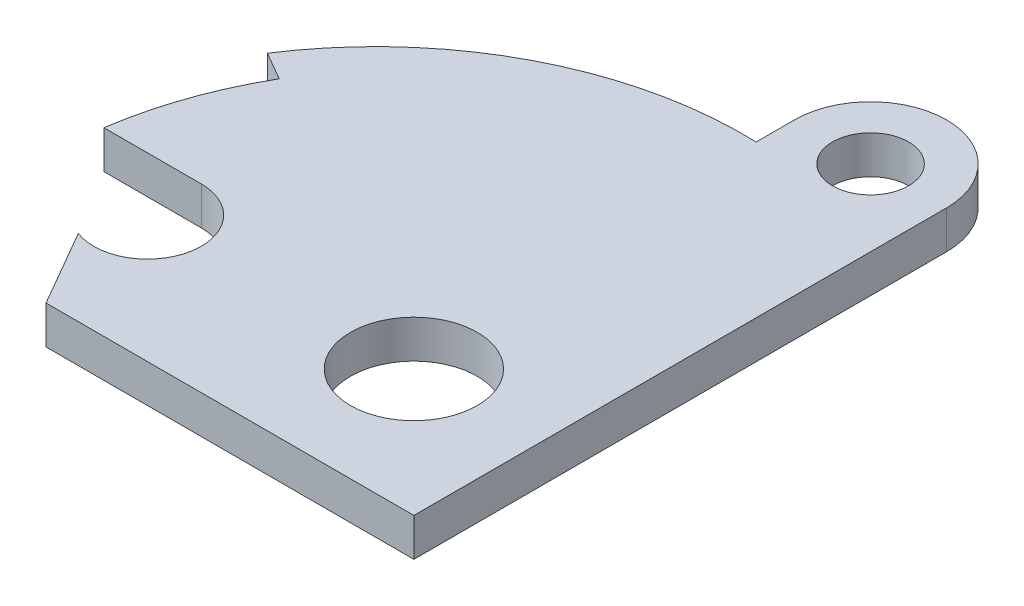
ISO-10303-21;
HEADER;
FILE_DESCRIPTION(('STEP AP214'),'2;1');
FILE_NAME('part.step','',(''),(''),'','','');
FILE_SCHEMA(('AUTOMOTIVE_DESIGN { 1 0 10303 214 1 1 1 1 }'));
ENDSEC;
DATA;
#1=APPLICATION_CONTEXT('core data for automotive mechanical design processes');
#2=APPLICATION_PROTOCOL_DEFINITION('international standard','automotive_design',2000,#1);
#3=PRODUCT_CONTEXT('',#1,'mechanical');
#4=PRODUCT('Part','Part','',(#3));
#5=PRODUCT_RELATED_PRODUCT_CATEGORY('part','',(#4));
#6=PRODUCT_DEFINITION_FORMATION('','',#4);
#7=PRODUCT_DEFINITION_CONTEXT('part definition',#1,'design');
#8=PRODUCT_DEFINITION('design','',#6,#7);
#9=PRODUCT_DEFINITION_SHAPE('','',#8);
#10=(LENGTH_UNIT() NAMED_UNIT(*) SI_UNIT(.MILLI.,.METRE.));
#11=(NAMED_UNIT(*) PLANE_ANGLE_UNIT() SI_UNIT($,.RADIAN.));
#12=(NAMED_UNIT(*) SI_UNIT($,.STERADIAN.) SOLID_ANGLE_UNIT());
#13=UNCERTAINTY_MEASURE_WITH_UNIT(LENGTH_MEASURE(1.E-05),#10,'distance_accuracy_value','');
#14=(GEOMETRIC_REPRESENTATION_CONTEXT(3) GLOBAL_UNCERTAINTY_ASSIGNED_CONTEXT((#13)) GLOBAL_UNIT_ASSIGNED_CONTEXT((#10,
#11,#12)) REPRESENTATION_CONTEXT('',''));
#15=CARTESIAN_POINT('',(0.,0.,0.));
#16=DIRECTION('',(0.,0.,1.));
#17=DIRECTION('',(1.,0.,0.));
#18=AXIS2_PLACEMENT_3D('',#15,#16,#17);
#19=CARTESIAN_POINT('',(-31.,3.,-10.));
#20=DIRECTION('',(0.,1.,0.));
#21=DIRECTION('',(0.,0.,1.));
#22=AXIS2_PLACEMENT_3D('',#19,#20,#21);
#23=PLANE('',#22);
#24=CARTESIAN_POINT('',(-6.,3.,-42.));
#25=DIRECTION('',(0.,1.,0.));
#26=DIRECTION('',(0.,0.,1.));
#27=AXIS2_PLACEMENT_3D('',#24,#25,#26);
#28=CIRCLE('',#27,3.);
#29=CARTESIAN_POINT('',(-6.,3.,-39.));
#30=VERTEX_POINT('',#29);
#31=EDGE_CURVE('E143',#30,#30,#28,.T.);
#32=ORIENTED_EDGE('',*,*,#31,.F.);
#33=EDGE_LOOP('',(#32));
#34=FACE_BOUND('',#33,.T.);
#35=DIRECTION('',(1.,0.,0.));
#36=VECTOR('',#35,1.);
#37=CARTESIAN_POINT('',(0.,3.,0.));
#38=LINE('',#37,#36);
#39=CARTESIAN_POINT('',(-29.,3.,0.));
#40=VERTEX_POINT('',#39);
#41=CARTESIAN_POINT('',(0.,3.,0.));
#42=VERTEX_POINT('',#41);
#43=EDGE_CURVE('E158',#40,#42,#38,.T.);
#44=ORIENTED_EDGE('',*,*,#43,.T.);
#45=DIRECTION('',(0.,0.,-1.));
#46=VECTOR('',#45,1.);
#47=CARTESIAN_POINT('',(0.,3.,0.));
#48=LINE('',#47,#46);
#49=CARTESIAN_POINT('',(0.,3.,-42.));
#50=VERTEX_POINT('',#49);
#51=EDGE_CURVE('E96',#42,#50,#48,.T.);
#52=ORIENTED_EDGE('',*,*,#51,.T.);
#53=CARTESIAN_POINT('',(-6.,3.,-42.));
#54=DIRECTION('',(0.,1.,0.));
#55=DIRECTION('',(0.,0.,1.));
#56=AXIS2_PLACEMENT_3D('',#53,#54,#55);
#57=CIRCLE('',#56,6.);
#58=CARTESIAN_POINT('',(-12.,3.,-42.));
#59=VERTEX_POINT('',#58);
#60=EDGE_CURVE('E179',#50,#59,#57,.T.);
#61=ORIENTED_EDGE('',*,*,#60,.T.);
#62=DIRECTION('',(0.,0.,1.));
#63=VECTOR('',#62,1.);
#64=CARTESIAN_POINT('',(-12.,3.,-38.9827534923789));
#65=LINE('',#64,#63);
#66=CARTESIAN_POINT('',(-12.,3.,-38.9827534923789));
#67=VERTEX_POINT('',#66);
#68=EDGE_CURVE('E198',#59,#67,#65,.T.);
#69=ORIENTED_EDGE('',*,*,#68,.T.);
#70=CARTESIAN_POINT('',(-13.,3.,-10.));
#71=DIRECTION('',(0.,1.,0.));
#72=DIRECTION('',(0.,0.,1.));
#73=AXIS2_PLACEMENT_3D('',#70,#71,#72);
#74=CIRCLE('',#73,29.);
#75=CARTESIAN_POINT('',(-37.3311183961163,3.,-25.7796285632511));
#76=VERTEX_POINT('',#75);
#77=EDGE_CURVE('E195',#67,#76,#74,.T.);
#78=ORIENTED_EDGE('',*,*,#77,.T.);
#79=DIRECTION('',(0.866025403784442,0.,0.499999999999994));
#80=VECTOR('',#79,1.);
#81=CARTESIAN_POINT('',(-35.1147367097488,3.,-24.4999999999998));
#82=LINE('',#81,#80);
#83=CARTESIAN_POINT('',(-35.1147367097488,3.,-24.4999999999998));
#84=VERTEX_POINT('',#83);
#85=EDGE_CURVE('E197',#76,#84,#82,.T.);
#86=ORIENTED_EDGE('',*,*,#85,.T.);
#87=CARTESIAN_POINT('',(-10.,3.,-10.));
#88=DIRECTION('',(0.,1.,0.));
#89=DIRECTION('',(0.,0.,1.));
#90=AXIS2_PLACEMENT_3D('',#87,#88,#89);
#91=CIRCLE('',#90,29.);
#92=CARTESIAN_POINT('',(-38.6868872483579,3.,-14.25));
#93=VERTEX_POINT('',#92);
#94=EDGE_CURVE('E121',#84,#93,#91,.T.);
#95=ORIENTED_EDGE('',*,*,#94,.T.);
#96=DIRECTION('',(1.,0.,0.));
#97=VECTOR('',#96,1.);
#98=CARTESIAN_POINT('',(-31.,3.,-14.25));
#99=LINE('',#98,#97);
#100=CARTESIAN_POINT('',(-31.,3.,-14.25));
#101=VERTEX_POINT('',#100);
#102=EDGE_CURVE('E115',#93,#101,#99,.T.);
#103=ORIENTED_EDGE('',*,*,#102,.T.);
#104=CARTESIAN_POINT('',(-31.,3.,-10.));
#105=DIRECTION('',(0.,-1.,0.));
#106=DIRECTION('',(0.,0.,1.));
#107=AXIS2_PLACEMENT_3D('',#104,#105,#106);
#108=CIRCLE('',#107,4.25000000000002);
#109=CARTESIAN_POINT('',(-32.4715424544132,3.,-6.01288791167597));
#110=VERTEX_POINT('',#109);
#111=EDGE_CURVE('E119',#101,#110,#108,.T.);
#112=ORIENTED_EDGE('',*,*,#111,.T.);
#113=DIRECTION('',(0.500000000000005,0.,0.866025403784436));
#114=VECTOR('',#113,1.);
#115=CARTESIAN_POINT('',(-29.,3.,0.));
#116=LINE('',#115,#114);
#117=EDGE_CURVE('E47',#110,#40,#116,.T.);
#118=ORIENTED_EDGE('',*,*,#117,.T.);
#119=EDGE_LOOP('',(#44,#52,#61,#69,#78,#86,#95,#103,#112,#118));
#120=FACE_BOUND('',#119,.T.);
#121=CARTESIAN_POINT('',(-10.,3.,-10.));
#122=DIRECTION('',(0.,1.,0.));
#123=DIRECTION('',(0.,0.,1.));
#124=AXIS2_PLACEMENT_3D('',#121,#122,#123);
#125=CIRCLE('',#124,5.);
#126=CARTESIAN_POINT('',(-10.,3.,-5.));
#127=VERTEX_POINT('',#126);
#128=EDGE_CURVE('E209',#127,#127,#125,.T.);
#129=ORIENTED_EDGE('',*,*,#128,.F.);
#130=EDGE_LOOP('',(#129));
#131=FACE_BOUND('',#130,.T.);
#132=ADVANCED_FACE('F30',(#34,#120,#131),#23,.T.);
#133=CARTESIAN_POINT('',(-31.,0.,-10.));
#134=DIRECTION('',(0.,1.,0.));
#135=DIRECTION('',(0.,0.,1.));
#136=AXIS2_PLACEMENT_3D('',#133,#134,#135);
#137=PLANE('',#136);
#138=CARTESIAN_POINT('',(-6.,0.,-42.));
#139=DIRECTION('',(0.,1.,0.));
#140=DIRECTION('',(0.,0.,1.));
#141=AXIS2_PLACEMENT_3D('',#138,#139,#140);
#142=CIRCLE('',#141,3.);
#143=CARTESIAN_POINT('',(-6.,0.,-39.));
#144=VERTEX_POINT('',#143);
#145=EDGE_CURVE('E206',#144,#144,#142,.T.);
#146=ORIENTED_EDGE('',*,*,#145,.T.);
#147=EDGE_LOOP('',(#146));
#148=FACE_BOUND('',#147,.T.);
#149=DIRECTION('',(1.,0.,0.));
#150=VECTOR('',#149,1.);
#151=CARTESIAN_POINT('',(0.,0.,0.));
#152=LINE('',#151,#150);
#153=CARTESIAN_POINT('',(-29.,0.,0.));
#154=VERTEX_POINT('',#153);
#155=CARTESIAN_POINT('',(0.,0.,0.));
#156=VERTEX_POINT('',#155);
#157=EDGE_CURVE('E139',#154,#156,#152,.T.);
#158=ORIENTED_EDGE('',*,*,#157,.F.);
#159=DIRECTION('',(0.500000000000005,0.,0.866025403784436));
#160=VECTOR('',#159,1.);
#161=CARTESIAN_POINT('',(-29.,0.,0.));
#162=LINE('',#161,#160);
#163=CARTESIAN_POINT('',(-32.4715424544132,0.,-6.01288791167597));
#164=VERTEX_POINT('',#163);
#165=EDGE_CURVE('E88',#164,#154,#162,.T.);
#166=ORIENTED_EDGE('',*,*,#165,.F.);
#167=CARTESIAN_POINT('',(-31.,0.,-10.));
#168=DIRECTION('',(0.,-1.,0.));
#169=DIRECTION('',(0.,0.,1.));
#170=AXIS2_PLACEMENT_3D('',#167,#168,#169);
#171=CIRCLE('',#170,4.25000000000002);
#172=CARTESIAN_POINT('',(-31.,0.,-14.25));
#173=VERTEX_POINT('',#172);
#174=EDGE_CURVE('E82',#173,#164,#171,.T.);
#175=ORIENTED_EDGE('',*,*,#174,.F.);
#176=DIRECTION('',(1.,0.,0.));
#177=VECTOR('',#176,1.);
#178=CARTESIAN_POINT('',(-31.,0.,-14.25));
#179=LINE('',#178,#177);
#180=CARTESIAN_POINT('',(-38.6868872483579,0.,-14.25));
#181=VERTEX_POINT('',#180);
#182=EDGE_CURVE('E129',#181,#173,#179,.T.);
#183=ORIENTED_EDGE('',*,*,#182,.F.);
#184=CARTESIAN_POINT('',(-10.,0.,-10.));
#185=DIRECTION('',(0.,1.,0.));
#186=DIRECTION('',(0.,0.,1.));
#187=AXIS2_PLACEMENT_3D('',#184,#185,#186);
#188=CIRCLE('',#187,29.);
#189=CARTESIAN_POINT('',(-35.1147367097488,0.,-24.4999999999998));
#190=VERTEX_POINT('',#189);
#191=EDGE_CURVE('E153',#190,#181,#188,.T.);
#192=ORIENTED_EDGE('',*,*,#191,.F.);
#193=DIRECTION('',(0.866025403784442,0.,0.499999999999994));
#194=VECTOR('',#193,1.);
#195=CARTESIAN_POINT('',(-35.1147367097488,0.,-24.4999999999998));
#196=LINE('',#195,#194);
#197=CARTESIAN_POINT('',(-37.3311183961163,0.,-25.7796285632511));
#198=VERTEX_POINT('',#197);
#199=EDGE_CURVE('E151',#198,#190,#196,.T.);
#200=ORIENTED_EDGE('',*,*,#199,.F.);
#201=CARTESIAN_POINT('',(-13.,0.,-10.));
#202=DIRECTION('',(0.,1.,0.));
#203=DIRECTION('',(0.,0.,1.));
#204=AXIS2_PLACEMENT_3D('',#201,#202,#203);
#205=CIRCLE('',#204,29.);
#206=CARTESIAN_POINT('',(-12.,0.,-38.9827534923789));
#207=VERTEX_POINT('',#206);
#208=EDGE_CURVE('E149',#207,#198,#205,.T.);
#209=ORIENTED_EDGE('',*,*,#208,.F.);
#210=DIRECTION('',(0.,0.,1.));
#211=VECTOR('',#210,1.);
#212=CARTESIAN_POINT('',(-12.,0.,-38.9827534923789));
#213=LINE('',#212,#211);
#214=CARTESIAN_POINT('',(-12.,0.,-42.));
#215=VERTEX_POINT('',#214);
#216=EDGE_CURVE('E147',#215,#207,#213,.T.);
#217=ORIENTED_EDGE('',*,*,#216,.F.);
#218=CARTESIAN_POINT('',(-6.,0.,-42.));
#219=DIRECTION('',(0.,1.,0.));
#220=DIRECTION('',(0.,0.,1.));
#221=AXIS2_PLACEMENT_3D('',#218,#219,#220);
#222=CIRCLE('',#221,6.);
#223=CARTESIAN_POINT('',(0.,0.,-42.));
#224=VERTEX_POINT('',#223);
#225=EDGE_CURVE('E145',#224,#215,#222,.T.);
#226=ORIENTED_EDGE('',*,*,#225,.F.);
#227=DIRECTION('',(0.,0.,-1.));
#228=VECTOR('',#227,1.);
#229=CARTESIAN_POINT('',(0.,0.,0.));
#230=LINE('',#229,#228);
#231=EDGE_CURVE('E142',#156,#224,#230,.T.);
#232=ORIENTED_EDGE('',*,*,#231,.F.);
#233=EDGE_LOOP('',(#158,#166,#175,#183,#192,#200,#209,#217,#226,#232));
#234=FACE_BOUND('',#233,.T.);
#235=CARTESIAN_POINT('',(-10.,0.,-10.));
#236=DIRECTION('',(0.,1.,0.));
#237=DIRECTION('',(0.,0.,1.));
#238=AXIS2_PLACEMENT_3D('',#235,#236,#237);
#239=CIRCLE('',#238,5.);
#240=CARTESIAN_POINT('',(-10.,0.,-5.));
#241=VERTEX_POINT('',#240);
#242=EDGE_CURVE('E212',#241,#241,#239,.T.);
#243=ORIENTED_EDGE('',*,*,#242,.T.);
#244=EDGE_LOOP('',(#243));
#245=FACE_BOUND('',#244,.T.);
#246=ADVANCED_FACE('F183',(#148,#234,#245),#137,.F.);
#247=CARTESIAN_POINT('',(0.,3.,0.));
#248=DIRECTION('',(0.,0.,-1.));
#249=DIRECTION('',(-1.,0.,0.));
#250=AXIS2_PLACEMENT_3D('',#247,#248,#249);
#251=PLANE('',#250);
#252=ORIENTED_EDGE('',*,*,#157,.T.);
#253=DIRECTION('',(0.,-1.,0.));
#254=VECTOR('',#253,1.);
#255=CARTESIAN_POINT('',(0.,3.,0.));
#256=LINE('',#255,#254);
#257=EDGE_CURVE('E11',#42,#156,#256,.T.);
#258=ORIENTED_EDGE('',*,*,#257,.F.);
#259=ORIENTED_EDGE('',*,*,#43,.F.);
#260=DIRECTION('',(0.,-1.,0.));
#261=VECTOR('',#260,1.);
#262=CARTESIAN_POINT('',(-29.,3.,0.));
#263=LINE('',#262,#261);
#264=EDGE_CURVE('E135',#40,#154,#263,.T.);
#265=ORIENTED_EDGE('',*,*,#264,.T.);
#266=EDGE_LOOP('',(#252,#258,#259,#265));
#267=FACE_BOUND('',#266,.T.);
#268=ADVANCED_FACE('F32',(#267),#251,.F.);
#269=CARTESIAN_POINT('',(0.,3.,0.));
#270=DIRECTION('',(-1.,0.,0.));
#271=DIRECTION('',(0.,0.,1.));
#272=AXIS2_PLACEMENT_3D('',#269,#270,#271);
#273=PLANE('',#272);
#274=ORIENTED_EDGE('',*,*,#231,.T.);
#275=DIRECTION('',(0.,-1.,0.));
#276=VECTOR('',#275,1.);
#277=CARTESIAN_POINT('',(0.,3.,-42.));
#278=LINE('',#277,#276);
#279=EDGE_CURVE('E39',#50,#224,#278,.T.);
#280=ORIENTED_EDGE('',*,*,#279,.F.);
#281=ORIENTED_EDGE('',*,*,#51,.F.);
#282=ORIENTED_EDGE('',*,*,#257,.T.);
#283=EDGE_LOOP('',(#274,#280,#281,#282));
#284=FACE_BOUND('',#283,.T.);
#285=ADVANCED_FACE('F253',(#284),#273,.F.);
#286=CARTESIAN_POINT('',(-6.,3.,-42.));
#287=DIRECTION('',(0.,-1.,0.));
#288=DIRECTION('',(0.,0.,-1.));
#289=AXIS2_PLACEMENT_3D('',#286,#287,#288);
#290=CYLINDRICAL_SURFACE('',#289,6.);
#291=ORIENTED_EDGE('',*,*,#225,.T.);
#292=DIRECTION('',(0.,-1.,0.));
#293=VECTOR('',#292,1.);
#294=CARTESIAN_POINT('',(-12.,3.,-42.));
#295=LINE('',#294,#293);
#296=EDGE_CURVE('E171',#59,#215,#295,.T.);
#297=ORIENTED_EDGE('',*,*,#296,.F.);
#298=ORIENTED_EDGE('',*,*,#60,.F.);
#299=ORIENTED_EDGE('',*,*,#279,.T.);
#300=EDGE_LOOP('',(#291,#297,#298,#299));
#301=FACE_BOUND('',#300,.T.);
#302=ADVANCED_FACE('F177',(#301),#290,.T.);
#303=CARTESIAN_POINT('',(-12.,3.,-38.9827534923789));
#304=DIRECTION('',(1.,0.,0.));
#305=DIRECTION('',(0.,0.,-1.));
#306=AXIS2_PLACEMENT_3D('',#303,#304,#305);
#307=PLANE('',#306);
#308=ORIENTED_EDGE('',*,*,#216,.T.);
#309=DIRECTION('',(0.,-1.,0.));
#310=VECTOR('',#309,1.);
#311=CARTESIAN_POINT('',(-12.,3.,-38.9827534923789));
#312=LINE('',#311,#310);
#313=EDGE_CURVE('E168',#67,#207,#312,.T.);
#314=ORIENTED_EDGE('',*,*,#313,.F.);
#315=ORIENTED_EDGE('',*,*,#68,.F.);
#316=ORIENTED_EDGE('',*,*,#296,.T.);
#317=EDGE_LOOP('',(#308,#314,#315,#316));
#318=FACE_BOUND('',#317,.T.);
#319=ADVANCED_FACE('F189',(#318),#307,.F.);
#320=CARTESIAN_POINT('',(-13.,3.,-10.));
#321=DIRECTION('',(0.,-1.,0.));
#322=DIRECTION('',(0.,0.,-1.));
#323=AXIS2_PLACEMENT_3D('',#320,#321,#322);
#324=CYLINDRICAL_SURFACE('',#323,29.);
#325=ORIENTED_EDGE('',*,*,#208,.T.);
#326=DIRECTION('',(0.,-1.,0.));
#327=VECTOR('',#326,1.);
#328=CARTESIAN_POINT('',(-37.3311183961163,3.,-25.7796285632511));
#329=LINE('',#328,#327);
#330=EDGE_CURVE('E165',#76,#198,#329,.T.);
#331=ORIENTED_EDGE('',*,*,#330,.F.);
#332=ORIENTED_EDGE('',*,*,#77,.F.);
#333=ORIENTED_EDGE('',*,*,#313,.T.);
#334=EDGE_LOOP('',(#325,#331,#332,#333));
#335=FACE_BOUND('',#334,.T.);
#336=ADVANCED_FACE('F193',(#335),#324,.T.);
#337=CARTESIAN_POINT('',(-35.1147367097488,3.,-24.4999999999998));
#338=DIRECTION('',(0.499999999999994,0.,-0.866025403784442));
#339=DIRECTION('',(-0.866025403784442,0.,-0.499999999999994));
#340=AXIS2_PLACEMENT_3D('',#337,#338,#339);
#341=PLANE('',#340);
#342=ORIENTED_EDGE('',*,*,#199,.T.);
#343=DIRECTION('',(0.,-1.,0.));
#344=VECTOR('',#343,1.);
#345=CARTESIAN_POINT('',(-35.1147367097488,3.,-24.4999999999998));
#346=LINE('',#345,#344);
#347=EDGE_CURVE('E162',#84,#190,#346,.T.);
#348=ORIENTED_EDGE('',*,*,#347,.F.);
#349=ORIENTED_EDGE('',*,*,#85,.F.);
#350=ORIENTED_EDGE('',*,*,#330,.T.);
#351=EDGE_LOOP('',(#342,#348,#349,#350));
#352=FACE_BOUND('',#351,.T.);
#353=ADVANCED_FACE('F243',(#352),#341,.F.);
#354=CARTESIAN_POINT('',(-10.,3.,-10.));
#355=DIRECTION('',(0.,-1.,0.));
#356=DIRECTION('',(0.,0.,-1.));
#357=AXIS2_PLACEMENT_3D('',#354,#355,#356);
#358=CYLINDRICAL_SURFACE('',#357,29.);
#359=ORIENTED_EDGE('',*,*,#191,.T.);
#360=DIRECTION('',(0.,-1.,0.));
#361=VECTOR('',#360,1.);
#362=CARTESIAN_POINT('',(-38.6868872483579,3.,-14.25));
#363=LINE('',#362,#361);
#364=EDGE_CURVE('E130',#93,#181,#363,.T.);
#365=ORIENTED_EDGE('',*,*,#364,.F.);
#366=ORIENTED_EDGE('',*,*,#94,.F.);
#367=ORIENTED_EDGE('',*,*,#347,.T.);
#368=EDGE_LOOP('',(#359,#365,#366,#367));
#369=FACE_BOUND('',#368,.T.);
#370=ADVANCED_FACE('F240',(#369),#358,.T.);
#371=CARTESIAN_POINT('',(-31.,3.,-14.25));
#372=DIRECTION('',(0.,0.,-1.));
#373=DIRECTION('',(-1.,0.,0.));
#374=AXIS2_PLACEMENT_3D('',#371,#372,#373);
#375=PLANE('',#374);
#376=ORIENTED_EDGE('',*,*,#182,.T.);
#377=DIRECTION('',(0.,-1.,0.));
#378=VECTOR('',#377,1.);
#379=CARTESIAN_POINT('',(-31.,3.,-14.25));
#380=LINE('',#379,#378);
#381=EDGE_CURVE('E126',#101,#173,#380,.T.);
#382=ORIENTED_EDGE('',*,*,#381,.F.);
#383=ORIENTED_EDGE('',*,*,#102,.F.);
#384=ORIENTED_EDGE('',*,*,#364,.T.);
#385=EDGE_LOOP('',(#376,#382,#383,#384));
#386=FACE_BOUND('',#385,.T.);
#387=ADVANCED_FACE('F127',(#386),#375,.F.);
#388=CARTESIAN_POINT('',(-31.,3.,-10.));
#389=DIRECTION('',(0.,-1.,0.));
#390=DIRECTION('',(0.,0.,-1.));
#391=AXIS2_PLACEMENT_3D('',#388,#389,#390);
#392=CYLINDRICAL_SURFACE('',#391,4.25000000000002);
#393=ORIENTED_EDGE('',*,*,#174,.T.);
#394=DIRECTION('',(0.,-1.,0.));
#395=VECTOR('',#394,1.);
#396=CARTESIAN_POINT('',(-32.4715424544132,3.,-6.01288791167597));
#397=LINE('',#396,#395);
#398=EDGE_CURVE('E131',#110,#164,#397,.T.);
#399=ORIENTED_EDGE('',*,*,#398,.F.);
#400=ORIENTED_EDGE('',*,*,#111,.F.);
#401=ORIENTED_EDGE('',*,*,#381,.T.);
#402=EDGE_LOOP('',(#393,#399,#400,#401));
#403=FACE_BOUND('',#402,.T.);
#404=ADVANCED_FACE('F133',(#403),#392,.F.);
#405=CARTESIAN_POINT('',(-29.,3.,0.));
#406=DIRECTION('',(0.866025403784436,0.,-0.500000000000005));
#407=DIRECTION('',(-0.500000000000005,0.,-0.866025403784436));
#408=AXIS2_PLACEMENT_3D('',#405,#406,#407);
#409=PLANE('',#408);
#410=ORIENTED_EDGE('',*,*,#165,.T.);
#411=ORIENTED_EDGE('',*,*,#264,.F.);
#412=ORIENTED_EDGE('',*,*,#117,.F.);
#413=ORIENTED_EDGE('',*,*,#398,.T.);
#414=EDGE_LOOP('',(#410,#411,#412,#413));
#415=FACE_BOUND('',#414,.T.);
#416=ADVANCED_FACE('F233',(#415),#409,.F.);
#417=CARTESIAN_POINT('',(-6.,3.,-42.));
#418=DIRECTION('',(0.,-1.,0.));
#419=DIRECTION('',(0.,0.,-1.));
#420=AXIS2_PLACEMENT_3D('',#417,#418,#419);
#421=CYLINDRICAL_SURFACE('',#420,3.);
#422=ORIENTED_EDGE('',*,*,#31,.T.);
#423=EDGE_LOOP('',(#422));
#424=FACE_BOUND('',#423,.T.);
#425=ORIENTED_EDGE('',*,*,#145,.F.);
#426=EDGE_LOOP('',(#425));
#427=FACE_BOUND('',#426,.T.);
#428=ADVANCED_FACE('F230',(#424,#427),#421,.F.);
#429=CARTESIAN_POINT('',(-10.,3.,-10.));
#430=DIRECTION('',(0.,-1.,0.));
#431=DIRECTION('',(0.,0.,-1.));
#432=AXIS2_PLACEMENT_3D('',#429,#430,#431);
#433=CYLINDRICAL_SURFACE('',#432,5.);
#434=ORIENTED_EDGE('',*,*,#128,.T.);
#435=EDGE_LOOP('',(#434));
#436=FACE_BOUND('',#435,.T.);
#437=ORIENTED_EDGE('',*,*,#242,.F.);
#438=EDGE_LOOP('',(#437));
#439=FACE_BOUND('',#438,.T.);
#440=ADVANCED_FACE('F218',(#436,#439),#433,.F.);
#441=CLOSED_SHELL('',(#132,#246,#268,#285,#302,#319,#336,#353,#370,#387,#404,#416,#428,#440));
#442=MANIFOLD_SOLID_BREP('B2',#441);
#443=ADVANCED_BREP_SHAPE_REPRESENTATION('',(#18,#442),#14);
#444=SHAPE_DEFINITION_REPRESENTATION(#9,#443);
ENDSEC;
END-ISO-10303-21;
